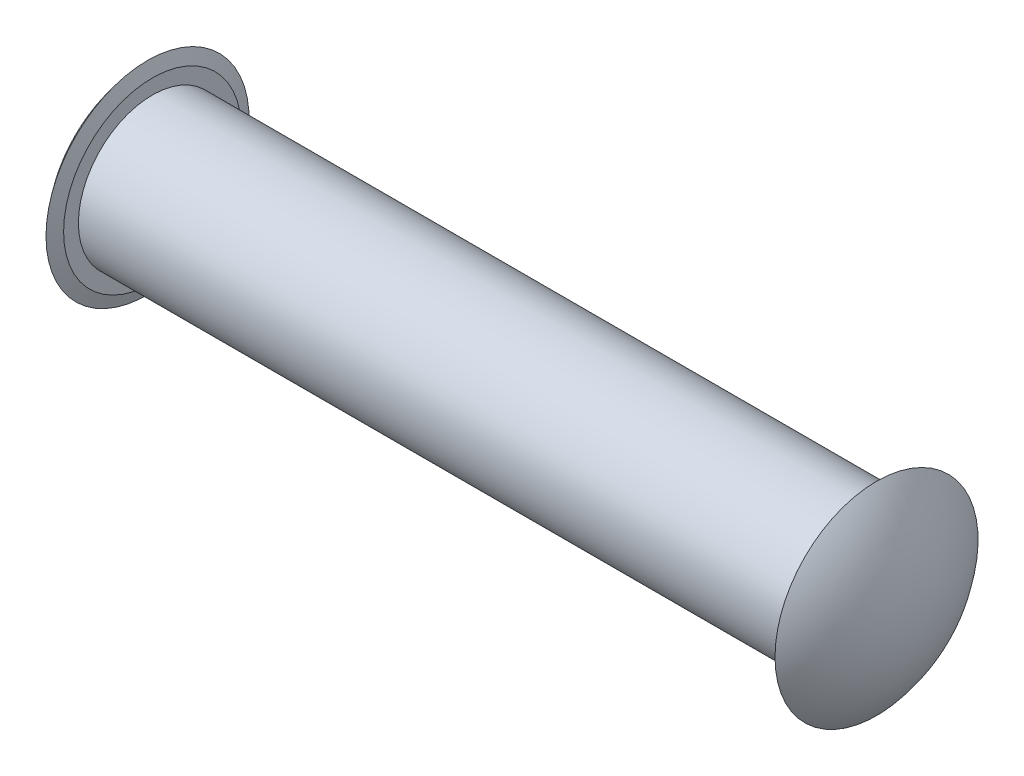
ISO-10303-21;
HEADER;
FILE_DESCRIPTION(('STEP AP214'),'2;1');
FILE_NAME('part.step','',(''),(''),'','','');
FILE_SCHEMA(('AUTOMOTIVE_DESIGN { 1 0 10303 214 1 1 1 1 }'));
ENDSEC;
DATA;
#1=APPLICATION_CONTEXT('core data for automotive mechanical design processes');
#2=APPLICATION_PROTOCOL_DEFINITION('international standard','automotive_design',2000,#1);
#3=PRODUCT_CONTEXT('',#1,'mechanical');
#4=PRODUCT('Part','Part','',(#3));
#5=PRODUCT_RELATED_PRODUCT_CATEGORY('part','',(#4));
#6=PRODUCT_DEFINITION_FORMATION('','',#4);
#7=PRODUCT_DEFINITION_CONTEXT('part definition',#1,'design');
#8=PRODUCT_DEFINITION('design','',#6,#7);
#9=PRODUCT_DEFINITION_SHAPE('','',#8);
#10=(LENGTH_UNIT() NAMED_UNIT(*) SI_UNIT(.MILLI.,.METRE.));
#11=(NAMED_UNIT(*) PLANE_ANGLE_UNIT() SI_UNIT($,.RADIAN.));
#12=(NAMED_UNIT(*) SI_UNIT($,.STERADIAN.) SOLID_ANGLE_UNIT());
#13=UNCERTAINTY_MEASURE_WITH_UNIT(LENGTH_MEASURE(1.E-05),#10,'distance_accuracy_value','');
#14=(GEOMETRIC_REPRESENTATION_CONTEXT(3) GLOBAL_UNCERTAINTY_ASSIGNED_CONTEXT((#13)) GLOBAL_UNIT_ASSIGNED_CONTEXT((#10,
#11,#12)) REPRESENTATION_CONTEXT('',''));
#15=CARTESIAN_POINT('',(0.,0.,0.));
#16=DIRECTION('',(0.,0.,1.));
#17=DIRECTION('',(1.,0.,0.));
#18=AXIS2_PLACEMENT_3D('',#15,#16,#17);
#19=CARTESIAN_POINT('',(-32.8984304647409,24.1968873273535,0.));
#20=DIRECTION('',(-1.,0.,0.));
#21=DIRECTION('',(0.,0.,1.));
#22=AXIS2_PLACEMENT_3D('',#19,#20,#21);
#23=PLANE('',#22);
#24=CARTESIAN_POINT('',(-32.8984304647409,20.6968873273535,0.));
#25=DIRECTION('',(-1.,0.,0.));
#26=DIRECTION('',(0.,0.,1.));
#27=AXIS2_PLACEMENT_3D('',#24,#25,#26);
#28=CIRCLE('',#27,4.2);
#29=CARTESIAN_POINT('',(-32.8984304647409,20.6968873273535,4.2));
#30=VERTEX_POINT('',#29);
#31=EDGE_CURVE('E10',#30,#30,#28,.T.);
#32=ORIENTED_EDGE('',*,*,#31,.F.);
#33=EDGE_LOOP('',(#32));
#34=FACE_BOUND('',#33,.T.);
#35=CARTESIAN_POINT('',(-32.8984304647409,20.6968873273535,0.));
#36=DIRECTION('',(-1.,0.,0.));
#37=DIRECTION('',(0.,0.,1.));
#38=AXIS2_PLACEMENT_3D('',#35,#36,#37);
#39=CIRCLE('',#38,3.5);
#40=CARTESIAN_POINT('',(-32.8984304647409,20.6968873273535,3.5));
#41=VERTEX_POINT('',#40);
#42=EDGE_CURVE('E368',#41,#41,#39,.T.);
#43=ORIENTED_EDGE('',*,*,#42,.T.);
#44=EDGE_LOOP('',(#43));
#45=FACE_BOUND('',#44,.T.);
#46=ADVANCED_FACE('F346',(#34,#45),#23,.F.);
#47=CARTESIAN_POINT('',(-32.8984304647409,20.6968873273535,0.));
#48=DIRECTION('',(-1.,0.,0.));
#49=DIRECTION('',(0.,0.,1.));
#50=AXIS2_PLACEMENT_3D('',#47,#48,#49);
#51=CONICAL_SURFACE('',#50,4.2,1.20176264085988);
#52=CARTESIAN_POINT('',(-33.1304816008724,20.6968873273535,0.));
#53=DIRECTION('',(-1.,0.,0.));
#54=DIRECTION('',(0.,0.,1.));
#55=AXIS2_PLACEMENT_3D('',#52,#53,#54);
#56=CIRCLE('',#55,4.8);
#57=CARTESIAN_POINT('',(-33.1304816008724,20.6968873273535,4.8));
#58=VERTEX_POINT('',#57);
#59=EDGE_CURVE('E352',#58,#58,#56,.T.);
#60=ORIENTED_EDGE('',*,*,#59,.F.);
#61=EDGE_LOOP('',(#60));
#62=FACE_BOUND('',#61,.T.);
#63=ORIENTED_EDGE('',*,*,#31,.T.);
#64=EDGE_LOOP('',(#63));
#65=FACE_BOUND('',#64,.T.);
#66=ADVANCED_FACE('F391',(#62,#65),#51,.T.);
#67=CARTESIAN_POINT('',(-27.4984304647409,20.6968873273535,0.));
#68=DIRECTION('',(-1.,0.,0.));
#69=DIRECTION('',(0.,1.,0.));
#70=AXIS2_PLACEMENT_3D('',#67,#68,#69);
#71=SPHERICAL_SURFACE('',#70,7.4);
#72=ORIENTED_EDGE('',*,*,#59,.T.);
#73=EDGE_LOOP('',(#72));
#74=FACE_BOUND('',#73,.T.);
#75=ADVANCED_FACE('F396',(#74),#71,.T.);
#76=CARTESIAN_POINT('',(-4.29843046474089,20.6968873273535,0.));
#77=DIRECTION('',(-1.,0.,0.));
#78=DIRECTION('',(0.,1.,0.));
#79=AXIS2_PLACEMENT_3D('',#76,#77,#78);
#80=SPHERICAL_SURFACE('',#79,7.4);
#81=CARTESIAN_POINT('',(1.3336206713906,20.6968873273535,0.));
#82=DIRECTION('',(-1.,0.,0.));
#83=DIRECTION('',(0.,0.,1.));
#84=AXIS2_PLACEMENT_3D('',#81,#82,#83);
#85=CIRCLE('',#84,4.8);
#86=CARTESIAN_POINT('',(1.3336206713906,20.6968873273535,4.8));
#87=VERTEX_POINT('',#86);
#88=EDGE_CURVE('E356',#87,#87,#85,.T.);
#89=ORIENTED_EDGE('',*,*,#88,.F.);
#90=EDGE_LOOP('',(#89));
#91=FACE_BOUND('',#90,.T.);
#92=ADVANCED_FACE('F387',(#91),#80,.T.);
#93=CARTESIAN_POINT('',(1.10156953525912,20.6968873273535,0.));
#94=DIRECTION('',(1.,0.,0.));
#95=DIRECTION('',(0.,0.,-1.));
#96=AXIS2_PLACEMENT_3D('',#93,#94,#95);
#97=CONICAL_SURFACE('',#96,4.2,1.20176264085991);
#98=ORIENTED_EDGE('',*,*,#88,.T.);
#99=EDGE_LOOP('',(#98));
#100=FACE_BOUND('',#99,.T.);
#101=CARTESIAN_POINT('',(1.10156953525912,20.6968873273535,0.));
#102=DIRECTION('',(-1.,0.,0.));
#103=DIRECTION('',(0.,0.,1.));
#104=AXIS2_PLACEMENT_3D('',#101,#102,#103);
#105=CIRCLE('',#104,4.2);
#106=CARTESIAN_POINT('',(1.10156953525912,20.6968873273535,4.2));
#107=VERTEX_POINT('',#106);
#108=EDGE_CURVE('E360',#107,#107,#105,.T.);
#109=ORIENTED_EDGE('',*,*,#108,.F.);
#110=EDGE_LOOP('',(#109));
#111=FACE_BOUND('',#110,.T.);
#112=ADVANCED_FACE('F381',(#100,#111),#97,.T.);
#113=CARTESIAN_POINT('',(1.10156953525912,24.1968873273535,0.));
#114=DIRECTION('',(-1.,0.,0.));
#115=DIRECTION('',(0.,0.,1.));
#116=AXIS2_PLACEMENT_3D('',#113,#114,#115);
#117=PLANE('',#116);
#118=ORIENTED_EDGE('',*,*,#108,.T.);
#119=EDGE_LOOP('',(#118));
#120=FACE_BOUND('',#119,.T.);
#121=CARTESIAN_POINT('',(1.10156953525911,20.6968873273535,0.));
#122=DIRECTION('',(-1.,0.,0.));
#123=DIRECTION('',(0.,0.,1.));
#124=AXIS2_PLACEMENT_3D('',#121,#122,#123);
#125=CIRCLE('',#124,3.5);
#126=CARTESIAN_POINT('',(1.10156953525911,20.6968873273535,3.5));
#127=VERTEX_POINT('',#126);
#128=EDGE_CURVE('E365',#127,#127,#125,.T.);
#129=ORIENTED_EDGE('',*,*,#128,.F.);
#130=EDGE_LOOP('',(#129));
#131=FACE_BOUND('',#130,.T.);
#132=ADVANCED_FACE('F376',(#120,#131),#117,.T.);
#133=CARTESIAN_POINT('',(-37.4841476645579,20.6968873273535,0.));
#134=DIRECTION('',(-1.,0.,0.));
#135=DIRECTION('',(0.,0.,1.));
#136=AXIS2_PLACEMENT_3D('',#133,#134,#135);
#137=CYLINDRICAL_SURFACE('',#136,3.5);
#138=ORIENTED_EDGE('',*,*,#42,.F.);
#139=EDGE_LOOP('',(#138));
#140=FACE_BOUND('',#139,.T.);
#141=ORIENTED_EDGE('',*,*,#128,.T.);
#142=EDGE_LOOP('',(#141));
#143=FACE_BOUND('',#142,.T.);
#144=ADVANCED_FACE('F373',(#140,#143),#137,.T.);
#145=CLOSED_SHELL('',(#46,#66,#75,#92,#112,#132,#144));
#146=MANIFOLD_SOLID_BREP('B2',#145);
#147=ADVANCED_BREP_SHAPE_REPRESENTATION('',(#18,#146),#14);
#148=SHAPE_DEFINITION_REPRESENTATION(#9,#147);
ENDSEC;
END-ISO-10303-21;
